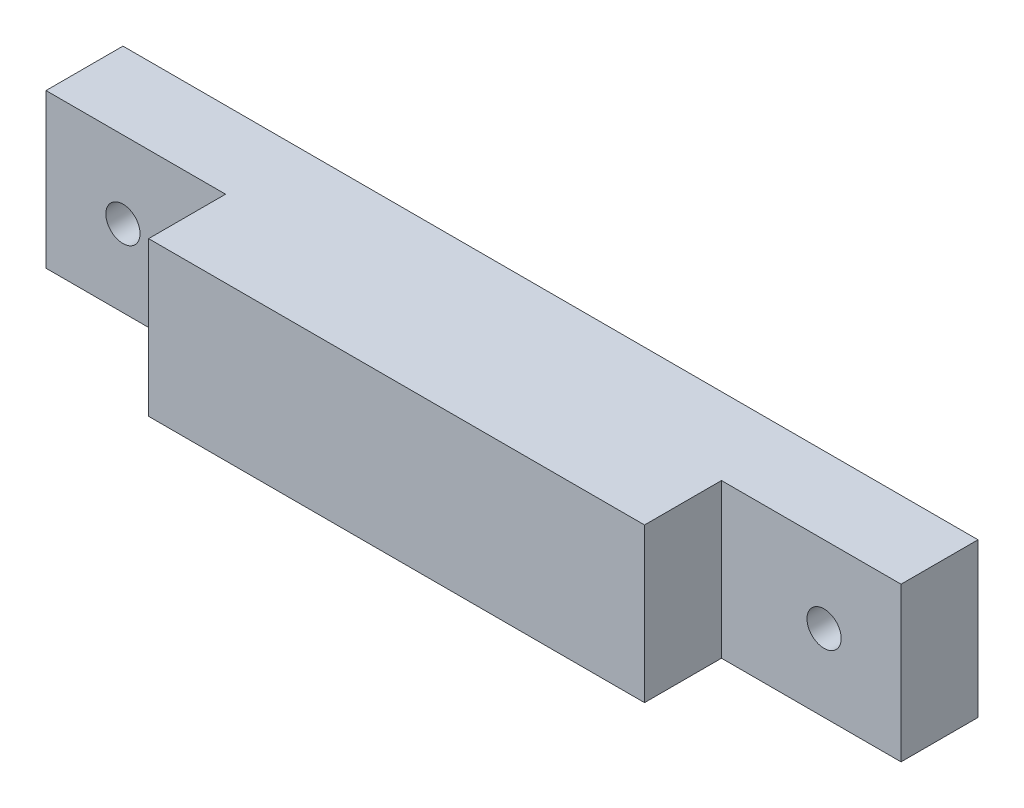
from build123d import *

# Parameters (mm, degrees)
ESQUISSE1_W                  = 50
ESQUISSE1_H                  = 9
EXTRUSION1_DEPTH             = 9
ENL_V_MAT_EXTRU_1_DEPTH      = 1
ENL_V_MAT_EXTRU_1_DEPTH_BACK = 4.5
ESQUISSE2_W                  = 10.5
ESQUISSE2_H                  = 9
ESQUISSE3_R                  = 1
ENL_V_MAT_EXTRU_2_DEPTH      = 4.5


with BuildPart() as part:
    # Esquisse1 → Extrusion1 (new body)
    with BuildSketch(Plane.XY):
        with Locations((25, 4.5)):
            Rectangle(ESQUISSE1_W, ESQUISSE1_H)
    extrude(amount=EXTRUSION1_DEPTH)

    # Esquisse2 → Enl_v. mat.-Extru.1 (cut, two sides: drawn at the far end of the back side and taken through both)
    with BuildSketch(Plane.XY.offset(9).offset(-ENL_V_MAT_EXTRU_1_DEPTH_BACK)):
        with Locations((5.25, 4.5)):
            Rectangle(ESQUISSE2_W, ESQUISSE2_H)
        with Locations((44.75, 4.5)):
            Rectangle(ESQUISSE2_W, ESQUISSE2_H)
    extrude(amount=ENL_V_MAT_EXTRU_1_DEPTH + ENL_V_MAT_EXTRU_1_DEPTH_BACK, mode=Mode.SUBTRACT)

    # Esquisse3 → Enl_v. mat.-Extru.2 (cut)
    with BuildSketch(Plane.XY.offset(4.5)):
        with Locations((45.5, 4.5)):
            Circle(ESQUISSE3_R)
        with Locations((4.5, 4.5)):
            Circle(ESQUISSE3_R)
    extrude(amount=-ENL_V_MAT_EXTRU_2_DEPTH, mode=Mode.SUBTRACT)


solid = part.part
